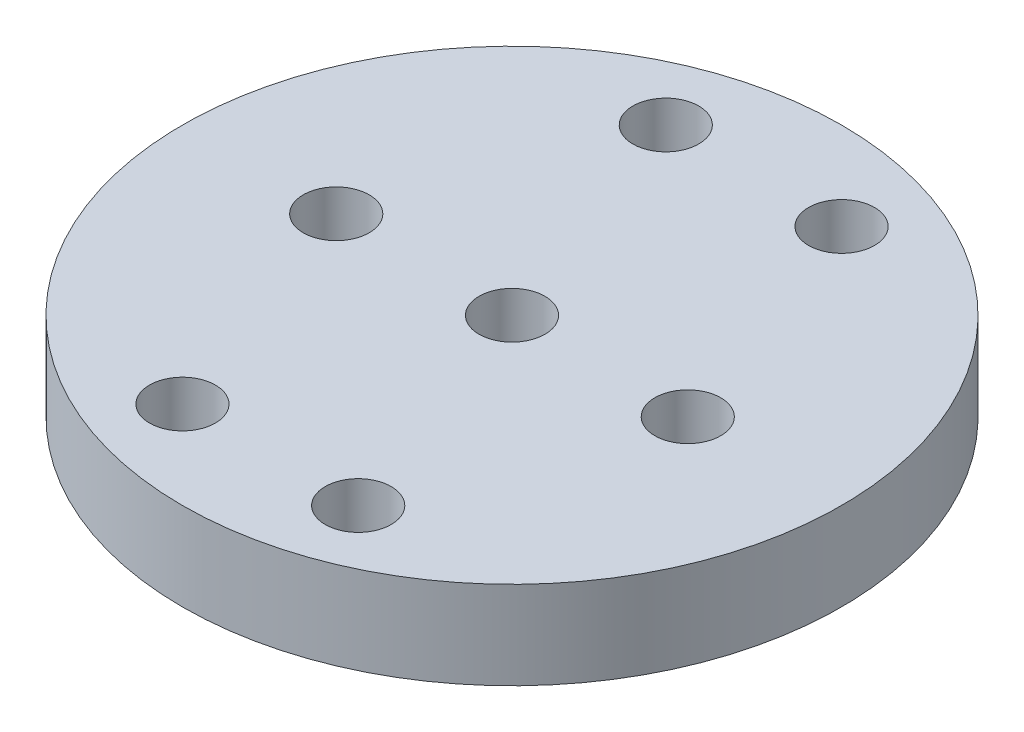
from build123d import *

# Parameters (mm, degrees)
SKETCH1_R          = 75
EXTRUDE1_DEPTH     = 20
SKETCH3_R          = 7.5
CUT_EXTRUDE1_DEPTH = 108.935165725


with BuildPart() as part:
    # Sketch1 → Extrude1 (new body)
    with BuildSketch(Plane(origin=(0, 0, 0), x_dir=(1, 0, 0), z_dir=(0, 1, 0))):
        with Locations(Location((0, 0, 0), (0, 0, 270))):
            Circle(SKETCH1_R)
    extrude(amount=EXTRUDE1_DEPTH)

    # Sketch3 → Cut-Extrude1 (cut, through all)
    with BuildSketch(Plane(origin=(0, 20, 0), x_dir=(-1, 0, 0), z_dir=(0, 1, 0))):
        with Locations(Location((0, 0, 0), (0, 0, 90))):
            Circle(SKETCH3_R)
    cut_extrude1 = extrude(amount=-CUT_EXTRUDE1_DEPTH, mode=Mode.SUBTRACT)

    # Sketch-Pattern1: Cut-Extrude1 at 6 more places
    with Locations((-20, 0, -55), (-40, 0, 0), (-20, 0, 55), (40, 0, 0), (20, 0, -55), (20, 0, 55)):
        add(cut_extrude1, mode=Mode.SUBTRACT)


solid = part.part
